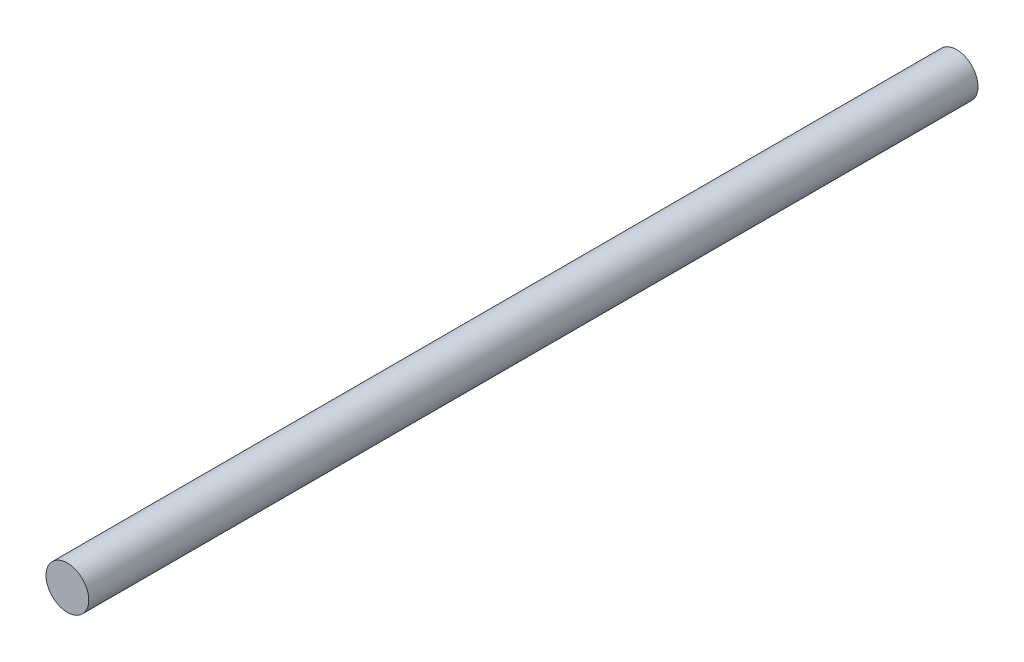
ISO-10303-21;
HEADER;
FILE_DESCRIPTION(('STEP AP214'),'2;1');
FILE_NAME('part.step','',(''),(''),'','','');
FILE_SCHEMA(('AUTOMOTIVE_DESIGN { 1 0 10303 214 1 1 1 1 }'));
ENDSEC;
DATA;
#1=APPLICATION_CONTEXT('core data for automotive mechanical design processes');
#2=APPLICATION_PROTOCOL_DEFINITION('international standard','automotive_design',2000,#1);
#3=PRODUCT_CONTEXT('',#1,'mechanical');
#4=PRODUCT('Part','Part','',(#3));
#5=PRODUCT_RELATED_PRODUCT_CATEGORY('part','',(#4));
#6=PRODUCT_DEFINITION_FORMATION('','',#4);
#7=PRODUCT_DEFINITION_CONTEXT('part definition',#1,'design');
#8=PRODUCT_DEFINITION('design','',#6,#7);
#9=PRODUCT_DEFINITION_SHAPE('','',#8);
#10=(LENGTH_UNIT() NAMED_UNIT(*) SI_UNIT(.MILLI.,.METRE.));
#11=(NAMED_UNIT(*) PLANE_ANGLE_UNIT() SI_UNIT($,.RADIAN.));
#12=(NAMED_UNIT(*) SI_UNIT($,.STERADIAN.) SOLID_ANGLE_UNIT());
#13=UNCERTAINTY_MEASURE_WITH_UNIT(LENGTH_MEASURE(1.E-05),#10,'distance_accuracy_value','');
#14=(GEOMETRIC_REPRESENTATION_CONTEXT(3) GLOBAL_UNCERTAINTY_ASSIGNED_CONTEXT((#13)) GLOBAL_UNIT_ASSIGNED_CONTEXT((#10,
#11,#12)) REPRESENTATION_CONTEXT('',''));
#15=CARTESIAN_POINT('',(0.,0.,0.));
#16=DIRECTION('',(0.,0.,1.));
#17=DIRECTION('',(1.,0.,0.));
#18=AXIS2_PLACEMENT_3D('',#15,#16,#17);
#19=CARTESIAN_POINT('',(0.,0.,624.));
#20=DIRECTION('',(0.,0.,1.));
#21=DIRECTION('',(0.,1.,0.));
#22=AXIS2_PLACEMENT_3D('',#19,#20,#21);
#23=PLANE('',#22);
#24=CARTESIAN_POINT('',(0.,0.,624.));
#25=DIRECTION('',(0.,0.,1.));
#26=DIRECTION('',(0.,1.,0.));
#27=AXIS2_PLACEMENT_3D('',#24,#25,#26);
#28=CIRCLE('',#27,15.);
#29=CARTESIAN_POINT('',(0.,15.,624.));
#30=VERTEX_POINT('',#29);
#31=EDGE_CURVE('E8',#30,#30,#28,.T.);
#32=ORIENTED_EDGE('',*,*,#31,.T.);
#33=EDGE_LOOP('',(#32));
#34=FACE_BOUND('',#33,.T.);
#35=ADVANCED_FACE('F12',(#34),#23,.T.);
#36=CARTESIAN_POINT('',(0.,0.,624.));
#37=DIRECTION('',(0.,0.,-1.));
#38=DIRECTION('',(0.,-1.,0.));
#39=AXIS2_PLACEMENT_3D('',#36,#37,#38);
#40=CYLINDRICAL_SURFACE('',#39,15.);
#41=ORIENTED_EDGE('',*,*,#31,.F.);
#42=EDGE_LOOP('',(#41));
#43=FACE_BOUND('',#42,.T.);
#44=CARTESIAN_POINT('',(0.,0.,0.));
#45=DIRECTION('',(0.,0.,1.));
#46=DIRECTION('',(0.,1.,0.));
#47=AXIS2_PLACEMENT_3D('',#44,#45,#46);
#48=CIRCLE('',#47,15.);
#49=CARTESIAN_POINT('',(0.,15.,0.));
#50=VERTEX_POINT('',#49);
#51=EDGE_CURVE('E16',#50,#50,#48,.T.);
#52=ORIENTED_EDGE('',*,*,#51,.T.);
#53=EDGE_LOOP('',(#52));
#54=FACE_BOUND('',#53,.T.);
#55=ADVANCED_FACE('F14',(#43,#54),#40,.T.);
#56=CARTESIAN_POINT('',(0.,0.,0.));
#57=DIRECTION('',(0.,0.,1.));
#58=DIRECTION('',(0.,1.,0.));
#59=AXIS2_PLACEMENT_3D('',#56,#57,#58);
#60=PLANE('',#59);
#61=ORIENTED_EDGE('',*,*,#51,.F.);
#62=EDGE_LOOP('',(#61));
#63=FACE_BOUND('',#62,.T.);
#64=ADVANCED_FACE('F26',(#63),#60,.F.);
#65=CLOSED_SHELL('',(#35,#55,#64));
#66=MANIFOLD_SOLID_BREP('B1',#65);
#67=ADVANCED_BREP_SHAPE_REPRESENTATION('',(#18,#66),#14);
#68=SHAPE_DEFINITION_REPRESENTATION(#9,#67);
ENDSEC;
END-ISO-10303-21;
